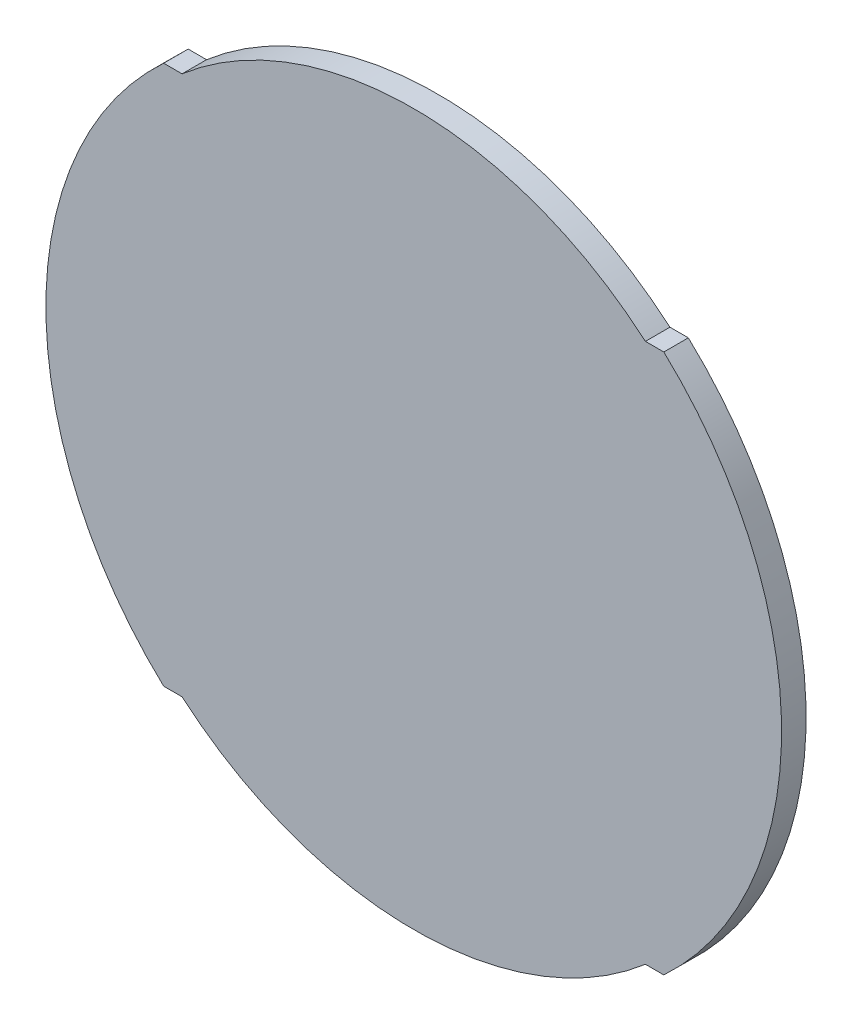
ISO-10303-21;
HEADER;
FILE_DESCRIPTION(('STEP AP214'),'2;1');
FILE_NAME('part.step','',(''),(''),'','','');
FILE_SCHEMA(('AUTOMOTIVE_DESIGN { 1 0 10303 214 1 1 1 1 }'));
ENDSEC;
DATA;
#1=APPLICATION_CONTEXT('core data for automotive mechanical design processes');
#2=APPLICATION_PROTOCOL_DEFINITION('international standard','automotive_design',2000,#1);
#3=PRODUCT_CONTEXT('',#1,'mechanical');
#4=PRODUCT('Part','Part','',(#3));
#5=PRODUCT_RELATED_PRODUCT_CATEGORY('part','',(#4));
#6=PRODUCT_DEFINITION_FORMATION('','',#4);
#7=PRODUCT_DEFINITION_CONTEXT('part definition',#1,'design');
#8=PRODUCT_DEFINITION('design','',#6,#7);
#9=PRODUCT_DEFINITION_SHAPE('','',#8);
#10=(LENGTH_UNIT() NAMED_UNIT(*) SI_UNIT(.MILLI.,.METRE.));
#11=(NAMED_UNIT(*) PLANE_ANGLE_UNIT() SI_UNIT($,.RADIAN.));
#12=(NAMED_UNIT(*) SI_UNIT($,.STERADIAN.) SOLID_ANGLE_UNIT());
#13=UNCERTAINTY_MEASURE_WITH_UNIT(LENGTH_MEASURE(1.E-05),#10,'distance_accuracy_value','');
#14=(GEOMETRIC_REPRESENTATION_CONTEXT(3) GLOBAL_UNCERTAINTY_ASSIGNED_CONTEXT((#13)) GLOBAL_UNIT_ASSIGNED_CONTEXT((#10,
#11,#12)) REPRESENTATION_CONTEXT('',''));
#15=CARTESIAN_POINT('',(0.,0.,0.));
#16=DIRECTION('',(0.,0.,1.));
#17=DIRECTION('',(1.,0.,0.));
#18=AXIS2_PLACEMENT_3D('',#15,#16,#17);
#19=CARTESIAN_POINT('',(0.,0.,1.5));
#20=DIRECTION('',(0.,0.,-1.));
#21=DIRECTION('',(-1.,0.,0.));
#22=AXIS2_PLACEMENT_3D('',#19,#20,#21);
#23=CYLINDRICAL_SURFACE('',#22,22.5);
#24=CARTESIAN_POINT('',(0.,0.,0.));
#25=DIRECTION('',(0.,0.,1.));
#26=DIRECTION('',(1.,0.,0.));
#27=AXIS2_PLACEMENT_3D('',#24,#25,#26);
#28=CIRCLE('',#27,22.5);
#29=CARTESIAN_POINT('',(-15.2970585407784,16.5,0.));
#30=VERTEX_POINT('',#29);
#31=CARTESIAN_POINT('',(-15.2970585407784,-16.5,0.));
#32=VERTEX_POINT('',#31);
#33=EDGE_CURVE('E97',#30,#32,#28,.T.);
#34=ORIENTED_EDGE('',*,*,#33,.T.);
#35=DIRECTION('',(0.,0.,-1.));
#36=VECTOR('',#35,1.);
#37=CARTESIAN_POINT('',(-15.2970585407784,-16.5,1.5));
#38=LINE('',#37,#36);
#39=CARTESIAN_POINT('',(-15.2970585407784,-16.5,1.5));
#40=VERTEX_POINT('',#39);
#41=EDGE_CURVE('E11',#40,#32,#38,.T.);
#42=ORIENTED_EDGE('',*,*,#41,.F.);
#43=CARTESIAN_POINT('',(0.,0.,1.5));
#44=DIRECTION('',(0.,0.,1.));
#45=DIRECTION('',(1.,0.,0.));
#46=AXIS2_PLACEMENT_3D('',#43,#44,#45);
#47=CIRCLE('',#46,22.5);
#48=CARTESIAN_POINT('',(-15.2970585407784,16.5,1.5));
#49=VERTEX_POINT('',#48);
#50=EDGE_CURVE('E124',#49,#40,#47,.T.);
#51=ORIENTED_EDGE('',*,*,#50,.F.);
#52=DIRECTION('',(0.,0.,-1.));
#53=VECTOR('',#52,1.);
#54=CARTESIAN_POINT('',(-15.2970585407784,16.5,1.5));
#55=LINE('',#54,#53);
#56=EDGE_CURVE('E110',#49,#30,#55,.T.);
#57=ORIENTED_EDGE('',*,*,#56,.T.);
#58=EDGE_LOOP('',(#34,#42,#51,#57));
#59=FACE_BOUND('',#58,.T.);
#60=ADVANCED_FACE('F29',(#59),#23,.T.);
#61=CARTESIAN_POINT('',(-15.2970585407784,-16.5,1.5));
#62=DIRECTION('',(0.,1.,0.));
#63=DIRECTION('',(0.,0.,1.));
#64=AXIS2_PLACEMENT_3D('',#61,#62,#63);
#65=PLANE('',#64);
#66=DIRECTION('',(1.,0.,0.));
#67=VECTOR('',#66,1.);
#68=CARTESIAN_POINT('',(-15.2970585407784,-16.5,0.));
#69=LINE('',#68,#67);
#70=CARTESIAN_POINT('',(-14.1708327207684,-16.5,0.));
#71=VERTEX_POINT('',#70);
#72=EDGE_CURVE('E93',#32,#71,#69,.T.);
#73=ORIENTED_EDGE('',*,*,#72,.T.);
#74=DIRECTION('',(0.,0.,-1.));
#75=VECTOR('',#74,1.);
#76=CARTESIAN_POINT('',(-14.1708327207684,-16.5,1.5));
#77=LINE('',#76,#75);
#78=CARTESIAN_POINT('',(-14.1708327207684,-16.5,1.5));
#79=VERTEX_POINT('',#78);
#80=EDGE_CURVE('E36',#79,#71,#77,.T.);
#81=ORIENTED_EDGE('',*,*,#80,.F.);
#82=DIRECTION('',(1.,0.,0.));
#83=VECTOR('',#82,1.);
#84=CARTESIAN_POINT('',(-15.2970585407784,-16.5,1.5));
#85=LINE('',#84,#83);
#86=EDGE_CURVE('E106',#40,#79,#85,.T.);
#87=ORIENTED_EDGE('',*,*,#86,.F.);
#88=ORIENTED_EDGE('',*,*,#41,.T.);
#89=EDGE_LOOP('',(#73,#81,#87,#88));
#90=FACE_BOUND('',#89,.T.);
#91=ADVANCED_FACE('F105',(#90),#65,.F.);
#92=CARTESIAN_POINT('',(0.,0.,1.5));
#93=DIRECTION('',(0.,0.,-1.));
#94=DIRECTION('',(-1.,0.,0.));
#95=AXIS2_PLACEMENT_3D('',#92,#93,#94);
#96=CYLINDRICAL_SURFACE('',#95,21.75);
#97=CARTESIAN_POINT('',(0.,0.,0.));
#98=DIRECTION('',(0.,0.,1.));
#99=DIRECTION('',(1.,0.,0.));
#100=AXIS2_PLACEMENT_3D('',#97,#98,#99);
#101=CIRCLE('',#100,21.75);
#102=CARTESIAN_POINT('',(14.1708327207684,-16.5,0.));
#103=VERTEX_POINT('',#102);
#104=EDGE_CURVE('E99',#71,#103,#101,.T.);
#105=ORIENTED_EDGE('',*,*,#104,.T.);
#106=DIRECTION('',(0.,0.,-1.));
#107=VECTOR('',#106,1.);
#108=CARTESIAN_POINT('',(14.1708327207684,-16.5,1.5));
#109=LINE('',#108,#107);
#110=CARTESIAN_POINT('',(14.1708327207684,-16.5,1.5));
#111=VERTEX_POINT('',#110);
#112=EDGE_CURVE('E150',#111,#103,#109,.T.);
#113=ORIENTED_EDGE('',*,*,#112,.F.);
#114=CARTESIAN_POINT('',(0.,0.,1.5));
#115=DIRECTION('',(0.,0.,1.));
#116=DIRECTION('',(1.,0.,0.));
#117=AXIS2_PLACEMENT_3D('',#114,#115,#116);
#118=CIRCLE('',#117,21.75);
#119=EDGE_CURVE('E127',#79,#111,#118,.T.);
#120=ORIENTED_EDGE('',*,*,#119,.F.);
#121=ORIENTED_EDGE('',*,*,#80,.T.);
#122=EDGE_LOOP('',(#105,#113,#120,#121));
#123=FACE_BOUND('',#122,.T.);
#124=ADVANCED_FACE('F154',(#123),#96,.T.);
#125=CARTESIAN_POINT('',(14.1708327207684,-16.5,1.5));
#126=DIRECTION('',(0.,1.,0.));
#127=DIRECTION('',(-1.,0.,0.));
#128=AXIS2_PLACEMENT_3D('',#125,#126,#127);
#129=PLANE('',#128);
#130=DIRECTION('',(1.,0.,0.));
#131=VECTOR('',#130,1.);
#132=CARTESIAN_POINT('',(14.1708327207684,-16.5,0.));
#133=LINE('',#132,#131);
#134=CARTESIAN_POINT('',(15.2970585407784,-16.5,0.));
#135=VERTEX_POINT('',#134);
#136=EDGE_CURVE('E114',#103,#135,#133,.T.);
#137=ORIENTED_EDGE('',*,*,#136,.T.);
#138=DIRECTION('',(0.,0.,-1.));
#139=VECTOR('',#138,1.);
#140=CARTESIAN_POINT('',(15.2970585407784,-16.5,1.5));
#141=LINE('',#140,#139);
#142=CARTESIAN_POINT('',(15.2970585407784,-16.5,1.5));
#143=VERTEX_POINT('',#142);
#144=EDGE_CURVE('E147',#143,#135,#141,.T.);
#145=ORIENTED_EDGE('',*,*,#144,.F.);
#146=DIRECTION('',(1.,0.,0.));
#147=VECTOR('',#146,1.);
#148=CARTESIAN_POINT('',(14.1708327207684,-16.5,1.5));
#149=LINE('',#148,#147);
#150=EDGE_CURVE('E129',#111,#143,#149,.T.);
#151=ORIENTED_EDGE('',*,*,#150,.F.);
#152=ORIENTED_EDGE('',*,*,#112,.T.);
#153=EDGE_LOOP('',(#137,#145,#151,#152));
#154=FACE_BOUND('',#153,.T.);
#155=ADVANCED_FACE('F162',(#154),#129,.F.);
#156=CARTESIAN_POINT('',(0.,0.,1.5));
#157=DIRECTION('',(0.,0.,-1.));
#158=DIRECTION('',(-1.,0.,0.));
#159=AXIS2_PLACEMENT_3D('',#156,#157,#158);
#160=CYLINDRICAL_SURFACE('',#159,22.5);
#161=CARTESIAN_POINT('',(0.,0.,0.));
#162=DIRECTION('',(0.,0.,1.));
#163=DIRECTION('',(1.,0.,0.));
#164=AXIS2_PLACEMENT_3D('',#161,#162,#163);
#165=CIRCLE('',#164,22.5);
#166=CARTESIAN_POINT('',(15.2970585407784,16.5,0.));
#167=VERTEX_POINT('',#166);
#168=EDGE_CURVE('E116',#135,#167,#165,.T.);
#169=ORIENTED_EDGE('',*,*,#168,.T.);
#170=DIRECTION('',(0.,0.,-1.));
#171=VECTOR('',#170,1.);
#172=CARTESIAN_POINT('',(15.2970585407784,16.5,1.5));
#173=LINE('',#172,#171);
#174=CARTESIAN_POINT('',(15.2970585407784,16.5,1.5));
#175=VERTEX_POINT('',#174);
#176=EDGE_CURVE('E144',#175,#167,#173,.T.);
#177=ORIENTED_EDGE('',*,*,#176,.F.);
#178=CARTESIAN_POINT('',(0.,0.,1.5));
#179=DIRECTION('',(0.,0.,1.));
#180=DIRECTION('',(1.,0.,0.));
#181=AXIS2_PLACEMENT_3D('',#178,#179,#180);
#182=CIRCLE('',#181,22.5);
#183=EDGE_CURVE('E131',#143,#175,#182,.T.);
#184=ORIENTED_EDGE('',*,*,#183,.F.);
#185=ORIENTED_EDGE('',*,*,#144,.T.);
#186=EDGE_LOOP('',(#169,#177,#184,#185));
#187=FACE_BOUND('',#186,.T.);
#188=ADVANCED_FACE('F165',(#187),#160,.T.);
#189=CARTESIAN_POINT('',(14.1708327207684,16.5,1.5));
#190=DIRECTION('',(0.,-1.,0.));
#191=DIRECTION('',(1.,0.,0.));
#192=AXIS2_PLACEMENT_3D('',#189,#190,#191);
#193=PLANE('',#192);
#194=DIRECTION('',(-1.,0.,0.));
#195=VECTOR('',#194,1.);
#196=CARTESIAN_POINT('',(14.1708327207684,16.5,0.));
#197=LINE('',#196,#195);
#198=CARTESIAN_POINT('',(14.1708327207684,16.5,0.));
#199=VERTEX_POINT('',#198);
#200=EDGE_CURVE('E118',#167,#199,#197,.T.);
#201=ORIENTED_EDGE('',*,*,#200,.T.);
#202=DIRECTION('',(0.,0.,-1.));
#203=VECTOR('',#202,1.);
#204=CARTESIAN_POINT('',(14.1708327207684,16.5,1.5));
#205=LINE('',#204,#203);
#206=CARTESIAN_POINT('',(14.1708327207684,16.5,1.5));
#207=VERTEX_POINT('',#206);
#208=EDGE_CURVE('E141',#207,#199,#205,.T.);
#209=ORIENTED_EDGE('',*,*,#208,.F.);
#210=DIRECTION('',(-1.,0.,0.));
#211=VECTOR('',#210,1.);
#212=CARTESIAN_POINT('',(14.1708327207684,16.5,1.5));
#213=LINE('',#212,#211);
#214=EDGE_CURVE('E133',#175,#207,#213,.T.);
#215=ORIENTED_EDGE('',*,*,#214,.F.);
#216=ORIENTED_EDGE('',*,*,#176,.T.);
#217=EDGE_LOOP('',(#201,#209,#215,#216));
#218=FACE_BOUND('',#217,.T.);
#219=ADVANCED_FACE('F170',(#218),#193,.F.);
#220=CARTESIAN_POINT('',(0.,0.,1.5));
#221=DIRECTION('',(0.,0.,-1.));
#222=DIRECTION('',(-1.,0.,0.));
#223=AXIS2_PLACEMENT_3D('',#220,#221,#222);
#224=CYLINDRICAL_SURFACE('',#223,21.75);
#225=CARTESIAN_POINT('',(0.,0.,0.));
#226=DIRECTION('',(0.,0.,1.));
#227=DIRECTION('',(1.,0.,0.));
#228=AXIS2_PLACEMENT_3D('',#225,#226,#227);
#229=CIRCLE('',#228,21.75);
#230=CARTESIAN_POINT('',(-14.1708327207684,16.5,0.));
#231=VERTEX_POINT('',#230);
#232=EDGE_CURVE('E120',#199,#231,#229,.T.);
#233=ORIENTED_EDGE('',*,*,#232,.T.);
#234=DIRECTION('',(0.,0.,-1.));
#235=VECTOR('',#234,1.);
#236=CARTESIAN_POINT('',(-14.1708327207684,16.5,1.5));
#237=LINE('',#236,#235);
#238=CARTESIAN_POINT('',(-14.1708327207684,16.5,1.5));
#239=VERTEX_POINT('',#238);
#240=EDGE_CURVE('E138',#239,#231,#237,.T.);
#241=ORIENTED_EDGE('',*,*,#240,.F.);
#242=CARTESIAN_POINT('',(0.,0.,1.5));
#243=DIRECTION('',(0.,0.,1.));
#244=DIRECTION('',(1.,0.,0.));
#245=AXIS2_PLACEMENT_3D('',#242,#243,#244);
#246=CIRCLE('',#245,21.75);
#247=EDGE_CURVE('E48',#207,#239,#246,.T.);
#248=ORIENTED_EDGE('',*,*,#247,.F.);
#249=ORIENTED_EDGE('',*,*,#208,.T.);
#250=EDGE_LOOP('',(#233,#241,#248,#249));
#251=FACE_BOUND('',#250,.T.);
#252=ADVANCED_FACE('F173',(#251),#224,.T.);
#253=CARTESIAN_POINT('',(-15.2970585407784,16.5,1.5));
#254=DIRECTION('',(0.,-1.,0.));
#255=DIRECTION('',(1.,0.,0.));
#256=AXIS2_PLACEMENT_3D('',#253,#254,#255);
#257=PLANE('',#256);
#258=DIRECTION('',(-1.,0.,0.));
#259=VECTOR('',#258,1.);
#260=CARTESIAN_POINT('',(-15.2970585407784,16.5,0.));
#261=LINE('',#260,#259);
#262=EDGE_CURVE('E122',#231,#30,#261,.T.);
#263=ORIENTED_EDGE('',*,*,#262,.T.);
#264=ORIENTED_EDGE('',*,*,#56,.F.);
#265=DIRECTION('',(-1.,0.,0.));
#266=VECTOR('',#265,1.);
#267=CARTESIAN_POINT('',(-15.2970585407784,16.5,1.5));
#268=LINE('',#267,#266);
#269=EDGE_CURVE('E43',#239,#49,#268,.T.);
#270=ORIENTED_EDGE('',*,*,#269,.F.);
#271=ORIENTED_EDGE('',*,*,#240,.T.);
#272=EDGE_LOOP('',(#263,#264,#270,#271));
#273=FACE_BOUND('',#272,.T.);
#274=ADVANCED_FACE('F175',(#273),#257,.F.);
#275=CARTESIAN_POINT('',(0.,0.,1.5));
#276=DIRECTION('',(0.,0.,1.));
#277=DIRECTION('',(1.,0.,0.));
#278=AXIS2_PLACEMENT_3D('',#275,#276,#277);
#279=PLANE('',#278);
#280=ORIENTED_EDGE('',*,*,#50,.T.);
#281=ORIENTED_EDGE('',*,*,#86,.T.);
#282=ORIENTED_EDGE('',*,*,#119,.T.);
#283=ORIENTED_EDGE('',*,*,#150,.T.);
#284=ORIENTED_EDGE('',*,*,#183,.T.);
#285=ORIENTED_EDGE('',*,*,#214,.T.);
#286=ORIENTED_EDGE('',*,*,#247,.T.);
#287=ORIENTED_EDGE('',*,*,#269,.T.);
#288=EDGE_LOOP('',(#280,#281,#282,#283,#284,#285,#286,#287));
#289=FACE_BOUND('',#288,.T.);
#290=ADVANCED_FACE('F157',(#289),#279,.T.);
#291=CARTESIAN_POINT('',(0.,0.,0.));
#292=DIRECTION('',(0.,0.,1.));
#293=DIRECTION('',(1.,0.,0.));
#294=AXIS2_PLACEMENT_3D('',#291,#292,#293);
#295=PLANE('',#294);
#296=ORIENTED_EDGE('',*,*,#33,.F.);
#297=ORIENTED_EDGE('',*,*,#262,.F.);
#298=ORIENTED_EDGE('',*,*,#232,.F.);
#299=ORIENTED_EDGE('',*,*,#200,.F.);
#300=ORIENTED_EDGE('',*,*,#168,.F.);
#301=ORIENTED_EDGE('',*,*,#136,.F.);
#302=ORIENTED_EDGE('',*,*,#104,.F.);
#303=ORIENTED_EDGE('',*,*,#72,.F.);
#304=EDGE_LOOP('',(#296,#297,#298,#299,#300,#301,#302,#303));
#305=FACE_BOUND('',#304,.T.);
#306=ADVANCED_FACE('F94',(#305),#295,.F.);
#307=CLOSED_SHELL('',(#60,#91,#124,#155,#188,#219,#252,#274,#290,#306));
#308=MANIFOLD_SOLID_BREP('B2',#307);
#309=ADVANCED_BREP_SHAPE_REPRESENTATION('',(#18,#308),#14);
#310=SHAPE_DEFINITION_REPRESENTATION(#9,#309);
ENDSEC;
END-ISO-10303-21;
